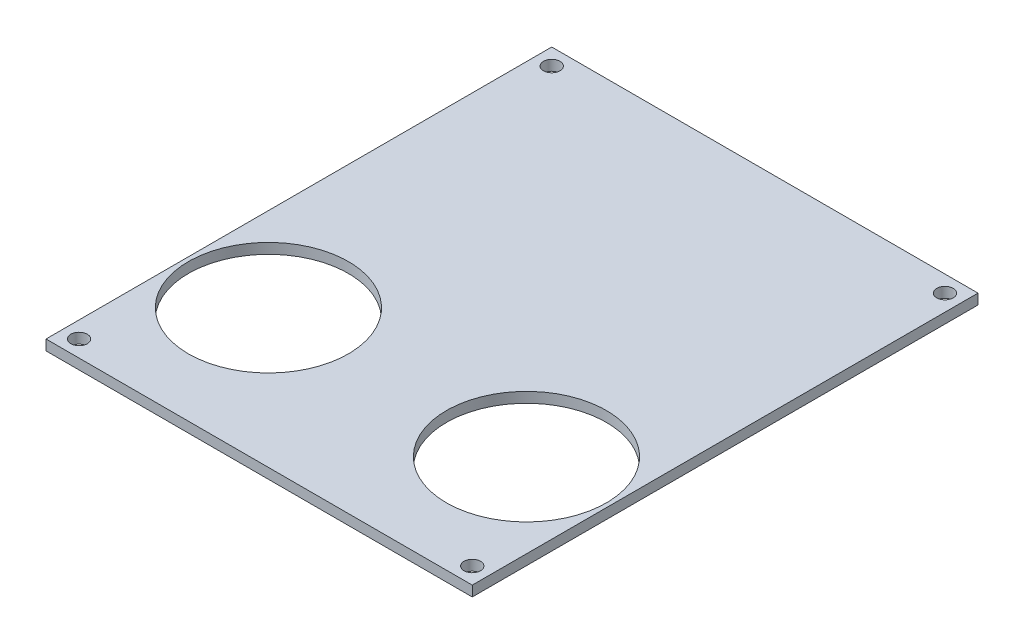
from build123d import *

# Parameters (mm, degrees)
SKETCH1_W                  = 82.6
SKETCH1_H                  = 98
BOSS_EXTRUDE1_DEPTH        = 2
F_3_2_3_2_DIAMETER_HOLE1_D = 3.2
SKETCH4_R                  = 15.5
CUT_EXTRUDE1_DEPTH         = 2


with BuildPart() as part:
    # Sketch1 → Boss-Extrude1 (new body)
    with BuildSketch(Plane(origin=(0, 0, 0), x_dir=(1, 0, 0), z_dir=(0, 1, 0))):
        Rectangle(SKETCH1_W, SKETCH1_H)
    extrude(amount=BOSS_EXTRUDE1_DEPTH)

    # 3.2 _3.2_ Diameter Hole1 (through all)
    with Locations(Plane(origin=(0, 2, 0), x_dir=(1, 0, 0), z_dir=(0, 1, 0))):
        with Locations((-38.1, 45.8), (38.1, 45.8), (38.1, -45.8), (-38.1, -45.8)):
            Hole(F_3_2_3_2_DIAMETER_HOLE1_D / 2)

    # Sketch4 → Cut-Extrude1 (cut)
    with BuildSketch(Plane(origin=(0, 2, 0), x_dir=(1, 0, 0), z_dir=(0, 1, 0))):
        with Locations(Location((-25, -22.2, 0), (0, 0, 270))):
            Circle(SKETCH4_R)
        with Locations(Location((25, -22.2, 0), (0, 0, 270))):
            Circle(SKETCH4_R)
    extrude(amount=-CUT_EXTRUDE1_DEPTH, mode=Mode.SUBTRACT)


solid = part.part
